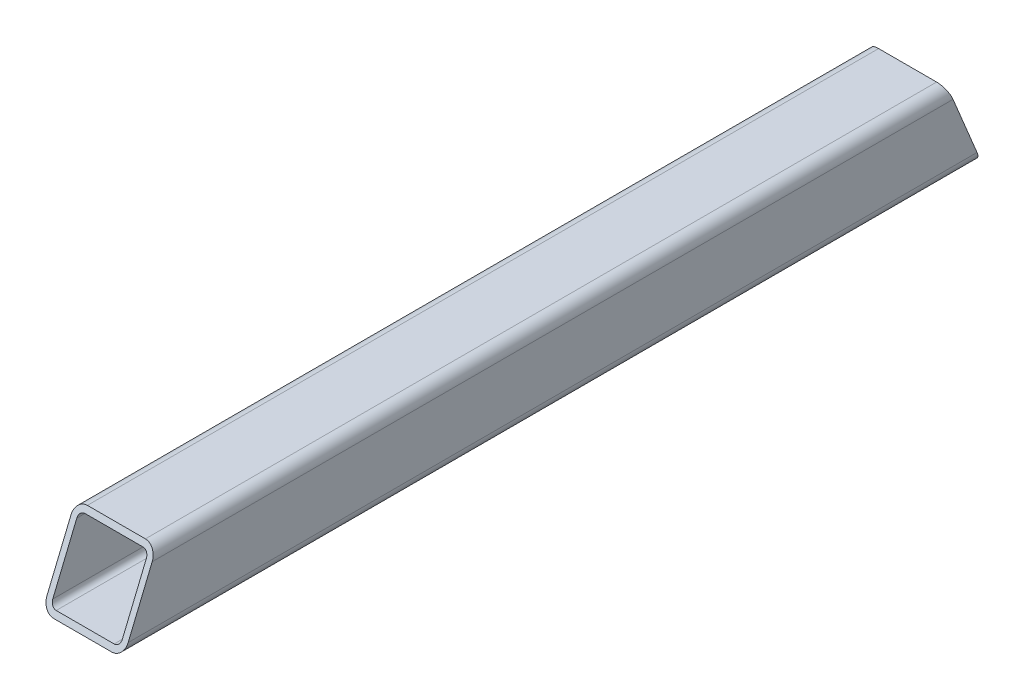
ISO-10303-21;
HEADER;
FILE_DESCRIPTION(('STEP AP214'),'2;1');
FILE_NAME('part.step','',(''),(''),'','','');
FILE_SCHEMA(('AUTOMOTIVE_DESIGN { 1 0 10303 214 1 1 1 1 }'));
ENDSEC;
DATA;
#1=APPLICATION_CONTEXT('core data for automotive mechanical design processes');
#2=APPLICATION_PROTOCOL_DEFINITION('international standard','automotive_design',2000,#1);
#3=PRODUCT_CONTEXT('',#1,'mechanical');
#4=PRODUCT('Part','Part','',(#3));
#5=PRODUCT_RELATED_PRODUCT_CATEGORY('part','',(#4));
#6=PRODUCT_DEFINITION_FORMATION('','',#4);
#7=PRODUCT_DEFINITION_CONTEXT('part definition',#1,'design');
#8=PRODUCT_DEFINITION('design','',#6,#7);
#9=PRODUCT_DEFINITION_SHAPE('','',#8);
#10=(LENGTH_UNIT() NAMED_UNIT(*) SI_UNIT(.MILLI.,.METRE.));
#11=(NAMED_UNIT(*) PLANE_ANGLE_UNIT() SI_UNIT($,.RADIAN.));
#12=(NAMED_UNIT(*) SI_UNIT($,.STERADIAN.) SOLID_ANGLE_UNIT());
#13=UNCERTAINTY_MEASURE_WITH_UNIT(LENGTH_MEASURE(1.E-05),#10,'distance_accuracy_value','');
#14=(GEOMETRIC_REPRESENTATION_CONTEXT(3) GLOBAL_UNCERTAINTY_ASSIGNED_CONTEXT((#13)) GLOBAL_UNIT_ASSIGNED_CONTEXT((#10,
#11,#12)) REPRESENTATION_CONTEXT('',''));
#15=CARTESIAN_POINT('',(0.,0.,0.));
#16=DIRECTION('',(0.,0.,1.));
#17=DIRECTION('',(1.,0.,0.));
#18=AXIS2_PLACEMENT_3D('',#15,#16,#17);
#19=CARTESIAN_POINT('',(-25.,-25.,370.));
#20=DIRECTION('',(0.,0.,-1.));
#21=DIRECTION('',(-1.,0.,0.));
#22=AXIS2_PLACEMENT_3D('',#19,#20,#21);
#23=CYLINDRICAL_SURFACE('',#22,9.99999999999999);
#24=DIRECTION('',(0.,0.,-1.));
#25=VECTOR('',#24,1.);
#26=CARTESIAN_POINT('',(-25.,-35.,370.));
#27=LINE('',#26,#25);
#28=CARTESIAN_POINT('',(-25.,-35.,370.));
#29=VERTEX_POINT('',#28);
#30=CARTESIAN_POINT('',(-25.,-35.,-370.));
#31=VERTEX_POINT('',#30);
#32=EDGE_CURVE('E39',#29,#31,#27,.T.);
#33=ORIENTED_EDGE('',*,*,#32,.F.);
#34=CARTESIAN_POINT('',(-25.,-25.,365.857864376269));
#35=DIRECTION('',(0.,-0.38268343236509,-0.923879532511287));
#36=DIRECTION('',(0.,0.923879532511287,-0.38268343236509));
#37=AXIS2_PLACEMENT_3D('',#34,#35,#36);
#38=ELLIPSE('',#37,10.8239220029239,9.99999999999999);
#39=CARTESIAN_POINT('',(-35.,-25.,365.857864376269));
#40=VERTEX_POINT('',#39);
#41=EDGE_CURVE('E162',#29,#40,#38,.T.);
#42=ORIENTED_EDGE('',*,*,#41,.T.);
#43=DIRECTION('',(0.,0.,-1.));
#44=VECTOR('',#43,1.);
#45=CARTESIAN_POINT('',(-35.,-25.,370.));
#46=LINE('',#45,#44);
#47=CARTESIAN_POINT('',(-35.,-25.,-365.857864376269));
#48=VERTEX_POINT('',#47);
#49=EDGE_CURVE('E167',#40,#48,#46,.T.);
#50=ORIENTED_EDGE('',*,*,#49,.T.);
#51=CARTESIAN_POINT('',(-25.,-25.,-365.857864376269));
#52=DIRECTION('',(0.,0.38268343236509,-0.923879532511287));
#53=DIRECTION('',(0.,-0.923879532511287,-0.38268343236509));
#54=AXIS2_PLACEMENT_3D('',#51,#52,#53);
#55=ELLIPSE('',#54,10.8239220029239,9.99999999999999);
#56=EDGE_CURVE('E188',#31,#48,#55,.T.);
#57=ORIENTED_EDGE('',*,*,#56,.F.);
#58=EDGE_LOOP('',(#33,#42,#50,#57));
#59=FACE_BOUND('',#58,.T.);
#60=ADVANCED_FACE('F32',(#59),#23,.T.);
#61=CARTESIAN_POINT('',(25.,-25.,370.));
#62=DIRECTION('',(0.,0.,-1.));
#63=DIRECTION('',(-1.,0.,0.));
#64=AXIS2_PLACEMENT_3D('',#61,#62,#63);
#65=CYLINDRICAL_SURFACE('',#64,10.);
#66=DIRECTION('',(0.,0.,-1.));
#67=VECTOR('',#66,1.);
#68=CARTESIAN_POINT('',(35.,-25.,370.));
#69=LINE('',#68,#67);
#70=CARTESIAN_POINT('',(35.,-25.,365.857864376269));
#71=VERTEX_POINT('',#70);
#72=CARTESIAN_POINT('',(35.,-25.,-365.857864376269));
#73=VERTEX_POINT('',#72);
#74=EDGE_CURVE('E156',#71,#73,#69,.T.);
#75=ORIENTED_EDGE('',*,*,#74,.F.);
#76=CARTESIAN_POINT('',(25.,-25.,365.857864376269));
#77=DIRECTION('',(0.,-0.38268343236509,-0.923879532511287));
#78=DIRECTION('',(0.,0.923879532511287,-0.38268343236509));
#79=AXIS2_PLACEMENT_3D('',#76,#77,#78);
#80=ELLIPSE('',#79,10.8239220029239,10.);
#81=CARTESIAN_POINT('',(24.9999999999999,-35.,370.));
#82=VERTEX_POINT('',#81);
#83=EDGE_CURVE('E159',#71,#82,#80,.T.);
#84=ORIENTED_EDGE('',*,*,#83,.T.);
#85=DIRECTION('',(0.,0.,-1.));
#86=VECTOR('',#85,1.);
#87=CARTESIAN_POINT('',(25.,-35.,370.));
#88=LINE('',#87,#86);
#89=CARTESIAN_POINT('',(25.,-35.,-370.));
#90=VERTEX_POINT('',#89);
#91=EDGE_CURVE('E144',#82,#90,#88,.T.);
#92=ORIENTED_EDGE('',*,*,#91,.T.);
#93=CARTESIAN_POINT('',(25.,-25.,-365.857864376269));
#94=DIRECTION('',(0.,0.38268343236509,-0.923879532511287));
#95=DIRECTION('',(0.,-0.923879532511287,-0.38268343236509));
#96=AXIS2_PLACEMENT_3D('',#93,#94,#95);
#97=ELLIPSE('',#96,10.8239220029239,10.);
#98=EDGE_CURVE('E190',#73,#90,#97,.T.);
#99=ORIENTED_EDGE('',*,*,#98,.F.);
#100=EDGE_LOOP('',(#75,#84,#92,#99));
#101=FACE_BOUND('',#100,.T.);
#102=ADVANCED_FACE('F160',(#101),#65,.T.);
#103=CARTESIAN_POINT('',(35.,25.,370.));
#104=DIRECTION('',(-1.,0.,0.));
#105=DIRECTION('',(0.,-1.,0.));
#106=AXIS2_PLACEMENT_3D('',#103,#104,#105);
#107=PLANE('',#106);
#108=DIRECTION('',(0.,0.,-1.));
#109=VECTOR('',#108,1.);
#110=CARTESIAN_POINT('',(35.,25.,370.));
#111=LINE('',#110,#109);
#112=CARTESIAN_POINT('',(35.,25.,345.147186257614));
#113=VERTEX_POINT('',#112);
#114=CARTESIAN_POINT('',(35.,25.,-345.147186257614));
#115=VERTEX_POINT('',#114);
#116=EDGE_CURVE('E181',#113,#115,#111,.T.);
#117=ORIENTED_EDGE('',*,*,#116,.F.);
#118=DIRECTION('',(0.,-0.923879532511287,0.38268343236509));
#119=VECTOR('',#118,1.);
#120=CARTESIAN_POINT('',(35.,16.2132034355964,348.786796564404));
#121=LINE('',#120,#119);
#122=EDGE_CURVE('E46',#113,#71,#121,.T.);
#123=ORIENTED_EDGE('',*,*,#122,.T.);
#124=ORIENTED_EDGE('',*,*,#74,.T.);
#125=DIRECTION('',(0.,-0.923879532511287,-0.38268343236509));
#126=VECTOR('',#125,1.);
#127=CARTESIAN_POINT('',(35.,277.842712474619,-240.416305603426));
#128=LINE('',#127,#126);
#129=EDGE_CURVE('E193',#115,#73,#128,.T.);
#130=ORIENTED_EDGE('',*,*,#129,.F.);
#131=EDGE_LOOP('',(#117,#123,#124,#130));
#132=FACE_BOUND('',#131,.T.);
#133=ADVANCED_FACE('F250',(#132),#107,.F.);
#134=CARTESIAN_POINT('',(25.,25.,370.));
#135=DIRECTION('',(0.,0.,-1.));
#136=DIRECTION('',(-1.,0.,0.));
#137=AXIS2_PLACEMENT_3D('',#134,#135,#136);
#138=CYLINDRICAL_SURFACE('',#137,10.);
#139=DIRECTION('',(0.,0.,-1.));
#140=VECTOR('',#139,1.);
#141=CARTESIAN_POINT('',(25.,35.,370.));
#142=LINE('',#141,#140);
#143=CARTESIAN_POINT('',(25.,35.,341.005050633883));
#144=VERTEX_POINT('',#143);
#145=CARTESIAN_POINT('',(25.,35.,-341.005050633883));
#146=VERTEX_POINT('',#145);
#147=EDGE_CURVE('E179',#144,#146,#142,.T.);
#148=ORIENTED_EDGE('',*,*,#147,.F.);
#149=CARTESIAN_POINT('',(25.,25.,345.147186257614));
#150=DIRECTION('',(0.,-0.38268343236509,-0.923879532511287));
#151=DIRECTION('',(0.,0.923879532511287,-0.38268343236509));
#152=AXIS2_PLACEMENT_3D('',#149,#150,#151);
#153=ELLIPSE('',#152,10.8239220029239,10.);
#154=EDGE_CURVE('E54',#144,#113,#153,.T.);
#155=ORIENTED_EDGE('',*,*,#154,.T.);
#156=ORIENTED_EDGE('',*,*,#116,.T.);
#157=CARTESIAN_POINT('',(25.,25.,-345.147186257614));
#158=DIRECTION('',(0.,0.38268343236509,-0.923879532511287));
#159=DIRECTION('',(0.,-0.923879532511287,-0.38268343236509));
#160=AXIS2_PLACEMENT_3D('',#157,#158,#159);
#161=ELLIPSE('',#160,10.8239220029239,10.);
#162=EDGE_CURVE('E197',#146,#115,#161,.T.);
#163=ORIENTED_EDGE('',*,*,#162,.F.);
#164=EDGE_LOOP('',(#148,#155,#156,#163));
#165=FACE_BOUND('',#164,.T.);
#166=ADVANCED_FACE('F249',(#165),#138,.T.);
#167=CARTESIAN_POINT('',(-25.,35.,370.));
#168=DIRECTION('',(0.,-1.,0.));
#169=DIRECTION('',(0.,0.,-1.));
#170=AXIS2_PLACEMENT_3D('',#167,#168,#169);
#171=PLANE('',#170);
#172=DIRECTION('',(0.,0.,-1.));
#173=VECTOR('',#172,1.);
#174=CARTESIAN_POINT('',(-25.,35.,370.));
#175=LINE('',#174,#173);
#176=CARTESIAN_POINT('',(-25.,35.,341.005050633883));
#177=VERTEX_POINT('',#176);
#178=CARTESIAN_POINT('',(-25.,35.,-341.005050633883));
#179=VERTEX_POINT('',#178);
#180=EDGE_CURVE('E177',#177,#179,#175,.T.);
#181=ORIENTED_EDGE('',*,*,#180,.F.);
#182=DIRECTION('',(1.,0.,0.));
#183=VECTOR('',#182,1.);
#184=CARTESIAN_POINT('',(-25.,35.,341.005050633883));
#185=LINE('',#184,#183);
#186=EDGE_CURVE('E427',#177,#144,#185,.T.);
#187=ORIENTED_EDGE('',*,*,#186,.T.);
#188=ORIENTED_EDGE('',*,*,#147,.T.);
#189=DIRECTION('',(1.,0.,0.));
#190=VECTOR('',#189,1.);
#191=CARTESIAN_POINT('',(-25.,35.,-341.005050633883));
#192=LINE('',#191,#190);
#193=EDGE_CURVE('E245',#179,#146,#192,.T.);
#194=ORIENTED_EDGE('',*,*,#193,.F.);
#195=EDGE_LOOP('',(#181,#187,#188,#194));
#196=FACE_BOUND('',#195,.T.);
#197=ADVANCED_FACE('F257',(#196),#171,.F.);
#198=CARTESIAN_POINT('',(-25.,25.,370.));
#199=DIRECTION('',(0.,0.,-1.));
#200=DIRECTION('',(-1.,0.,0.));
#201=AXIS2_PLACEMENT_3D('',#198,#199,#200);
#202=CYLINDRICAL_SURFACE('',#201,9.99999999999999);
#203=DIRECTION('',(0.,0.,-1.));
#204=VECTOR('',#203,1.);
#205=CARTESIAN_POINT('',(-35.,25.,370.));
#206=LINE('',#205,#204);
#207=CARTESIAN_POINT('',(-35.,25.,345.147186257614));
#208=VERTEX_POINT('',#207);
#209=CARTESIAN_POINT('',(-35.,25.,-345.147186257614));
#210=VERTEX_POINT('',#209);
#211=EDGE_CURVE('E169',#208,#210,#206,.T.);
#212=ORIENTED_EDGE('',*,*,#211,.F.);
#213=CARTESIAN_POINT('',(-25.,25.,345.147186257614));
#214=DIRECTION('',(0.,-0.38268343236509,-0.923879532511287));
#215=DIRECTION('',(0.,0.923879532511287,-0.38268343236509));
#216=AXIS2_PLACEMENT_3D('',#213,#214,#215);
#217=ELLIPSE('',#216,10.8239220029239,9.99999999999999);
#218=EDGE_CURVE('E425',#208,#177,#217,.T.);
#219=ORIENTED_EDGE('',*,*,#218,.T.);
#220=ORIENTED_EDGE('',*,*,#180,.T.);
#221=CARTESIAN_POINT('',(-25.,25.,-345.147186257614));
#222=DIRECTION('',(0.,0.38268343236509,-0.923879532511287));
#223=DIRECTION('',(0.,-0.923879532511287,-0.38268343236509));
#224=AXIS2_PLACEMENT_3D('',#221,#222,#223);
#225=ELLIPSE('',#224,10.8239220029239,9.99999999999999);
#226=EDGE_CURVE('E242',#210,#179,#225,.T.);
#227=ORIENTED_EDGE('',*,*,#226,.F.);
#228=EDGE_LOOP('',(#212,#219,#220,#227));
#229=FACE_BOUND('',#228,.T.);
#230=ADVANCED_FACE('F287',(#229),#202,.T.);
#231=CARTESIAN_POINT('',(-35.,25.,370.));
#232=DIRECTION('',(1.,0.,0.));
#233=DIRECTION('',(0.,0.,-1.));
#234=AXIS2_PLACEMENT_3D('',#231,#232,#233);
#235=PLANE('',#234);
#236=ORIENTED_EDGE('',*,*,#49,.F.);
#237=DIRECTION('',(0.,0.923879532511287,-0.38268343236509));
#238=VECTOR('',#237,1.);
#239=CARTESIAN_POINT('',(-35.,16.2132034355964,348.786796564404));
#240=LINE('',#239,#238);
#241=EDGE_CURVE('E418',#40,#208,#240,.T.);
#242=ORIENTED_EDGE('',*,*,#241,.T.);
#243=ORIENTED_EDGE('',*,*,#211,.T.);
#244=DIRECTION('',(0.,0.923879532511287,0.38268343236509));
#245=VECTOR('',#244,1.);
#246=CARTESIAN_POINT('',(-35.,277.842712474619,-240.416305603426));
#247=LINE('',#246,#245);
#248=EDGE_CURVE('E232',#48,#210,#247,.T.);
#249=ORIENTED_EDGE('',*,*,#248,.F.);
#250=EDGE_LOOP('',(#236,#242,#243,#249));
#251=FACE_BOUND('',#250,.T.);
#252=ADVANCED_FACE('F297',(#251),#235,.F.);
#253=CARTESIAN_POINT('',(-25.,25.,370.));
#254=DIRECTION('',(0.,0.,-1.));
#255=DIRECTION('',(-1.,0.,0.));
#256=AXIS2_PLACEMENT_3D('',#253,#254,#255);
#257=CYLINDRICAL_SURFACE('',#256,5.);
#258=CARTESIAN_POINT('',(-25.,25.,345.147186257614));
#259=DIRECTION('',(0.,-0.38268343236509,-0.923879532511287));
#260=DIRECTION('',(0.,0.923879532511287,-0.38268343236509));
#261=AXIS2_PLACEMENT_3D('',#258,#259,#260);
#262=ELLIPSE('',#261,5.41196100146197,5.);
#263=CARTESIAN_POINT('',(-30.,25.,345.147186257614));
#264=VERTEX_POINT('',#263);
#265=CARTESIAN_POINT('',(-25.,30.,343.076118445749));
#266=VERTEX_POINT('',#265);
#267=EDGE_CURVE('E224',#264,#266,#262,.T.);
#268=ORIENTED_EDGE('',*,*,#267,.F.);
#269=DIRECTION('',(0.,0.,-1.));
#270=VECTOR('',#269,1.);
#271=CARTESIAN_POINT('',(-30.,25.,370.));
#272=LINE('',#271,#270);
#273=CARTESIAN_POINT('',(-30.,25.,-345.147186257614));
#274=VERTEX_POINT('',#273);
#275=EDGE_CURVE('E171',#264,#274,#272,.T.);
#276=ORIENTED_EDGE('',*,*,#275,.T.);
#277=CARTESIAN_POINT('',(-25.,25.,-345.147186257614));
#278=DIRECTION('',(0.,0.38268343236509,-0.923879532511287));
#279=DIRECTION('',(0.,-0.923879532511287,-0.38268343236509));
#280=AXIS2_PLACEMENT_3D('',#277,#278,#279);
#281=ELLIPSE('',#280,5.41196100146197,5.);
#282=CARTESIAN_POINT('',(-25.,30.,-343.076118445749));
#283=VERTEX_POINT('',#282);
#284=EDGE_CURVE('E222',#274,#283,#281,.T.);
#285=ORIENTED_EDGE('',*,*,#284,.T.);
#286=DIRECTION('',(0.,0.,-1.));
#287=VECTOR('',#286,1.);
#288=CARTESIAN_POINT('',(-25.,30.,370.));
#289=LINE('',#288,#287);
#290=EDGE_CURVE('E195',#266,#283,#289,.T.);
#291=ORIENTED_EDGE('',*,*,#290,.F.);
#292=EDGE_LOOP('',(#268,#276,#285,#291));
#293=FACE_BOUND('',#292,.T.);
#294=ADVANCED_FACE('F220',(#293),#257,.F.);
#295=CARTESIAN_POINT('',(-30.,25.,370.));
#296=DIRECTION('',(1.,0.,0.));
#297=DIRECTION('',(0.,1.,0.));
#298=AXIS2_PLACEMENT_3D('',#295,#296,#297);
#299=PLANE('',#298);
#300=DIRECTION('',(0.,0.923879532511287,-0.38268343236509));
#301=VECTOR('',#300,1.);
#302=CARTESIAN_POINT('',(-30.,16.2132034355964,348.786796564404));
#303=LINE('',#302,#301);
#304=CARTESIAN_POINT('',(-30.,-25.,365.857864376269));
#305=VERTEX_POINT('',#304);
#306=EDGE_CURVE('E413',#305,#264,#303,.T.);
#307=ORIENTED_EDGE('',*,*,#306,.F.);
#308=DIRECTION('',(0.,0.,-1.));
#309=VECTOR('',#308,1.);
#310=CARTESIAN_POINT('',(-30.,-25.,370.));
#311=LINE('',#310,#309);
#312=CARTESIAN_POINT('',(-30.,-25.,-365.857864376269));
#313=VERTEX_POINT('',#312);
#314=EDGE_CURVE('E211',#305,#313,#311,.T.);
#315=ORIENTED_EDGE('',*,*,#314,.T.);
#316=DIRECTION('',(0.,0.923879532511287,0.38268343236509));
#317=VECTOR('',#316,1.);
#318=CARTESIAN_POINT('',(-30.,277.842712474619,-240.416305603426));
#319=LINE('',#318,#317);
#320=EDGE_CURVE('E229',#313,#274,#319,.T.);
#321=ORIENTED_EDGE('',*,*,#320,.T.);
#322=ORIENTED_EDGE('',*,*,#275,.F.);
#323=EDGE_LOOP('',(#307,#315,#321,#322));
#324=FACE_BOUND('',#323,.T.);
#325=ADVANCED_FACE('F234',(#324),#299,.T.);
#326=CARTESIAN_POINT('',(-25.,-25.,370.));
#327=DIRECTION('',(0.,0.,-1.));
#328=DIRECTION('',(-1.,0.,0.));
#329=AXIS2_PLACEMENT_3D('',#326,#327,#328);
#330=CYLINDRICAL_SURFACE('',#329,5.);
#331=CARTESIAN_POINT('',(-25.,-25.,365.857864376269));
#332=DIRECTION('',(0.,-0.38268343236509,-0.923879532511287));
#333=DIRECTION('',(0.,0.923879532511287,-0.38268343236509));
#334=AXIS2_PLACEMENT_3D('',#331,#332,#333);
#335=ELLIPSE('',#334,5.41196100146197,5.);
#336=CARTESIAN_POINT('',(-25.,-30.,367.928932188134));
#337=VERTEX_POINT('',#336);
#338=EDGE_CURVE('E416',#337,#305,#335,.T.);
#339=ORIENTED_EDGE('',*,*,#338,.F.);
#340=DIRECTION('',(0.,0.,-1.));
#341=VECTOR('',#340,1.);
#342=CARTESIAN_POINT('',(-25.,-30.,370.));
#343=LINE('',#342,#341);
#344=CARTESIAN_POINT('',(-25.,-30.,-367.928932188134));
#345=VERTEX_POINT('',#344);
#346=EDGE_CURVE('E210',#337,#345,#343,.T.);
#347=ORIENTED_EDGE('',*,*,#346,.T.);
#348=CARTESIAN_POINT('',(-25.,-25.,-365.857864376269));
#349=DIRECTION('',(0.,0.38268343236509,-0.923879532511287));
#350=DIRECTION('',(0.,-0.923879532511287,-0.38268343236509));
#351=AXIS2_PLACEMENT_3D('',#348,#349,#350);
#352=ELLIPSE('',#351,5.41196100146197,5.);
#353=EDGE_CURVE('E235',#345,#313,#352,.T.);
#354=ORIENTED_EDGE('',*,*,#353,.T.);
#355=ORIENTED_EDGE('',*,*,#314,.F.);
#356=EDGE_LOOP('',(#339,#347,#354,#355));
#357=FACE_BOUND('',#356,.T.);
#358=ADVANCED_FACE('F324',(#357),#330,.F.);
#359=CARTESIAN_POINT('',(-25.,-30.,370.));
#360=DIRECTION('',(0.,1.,0.));
#361=DIRECTION('',(-1.,0.,0.));
#362=AXIS2_PLACEMENT_3D('',#359,#360,#361);
#363=PLANE('',#362);
#364=DIRECTION('',(-1.,0.,0.));
#365=VECTOR('',#364,1.);
#366=CARTESIAN_POINT('',(-25.,-30.,367.928932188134));
#367=LINE('',#366,#365);
#368=CARTESIAN_POINT('',(25.,-30.,367.928932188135));
#369=VERTEX_POINT('',#368);
#370=EDGE_CURVE('E420',#369,#337,#367,.T.);
#371=ORIENTED_EDGE('',*,*,#370,.F.);
#372=DIRECTION('',(0.,0.,-1.));
#373=VECTOR('',#372,1.);
#374=CARTESIAN_POINT('',(25.,-30.,370.));
#375=LINE('',#374,#373);
#376=CARTESIAN_POINT('',(25.,-30.,-367.928932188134));
#377=VERTEX_POINT('',#376);
#378=EDGE_CURVE('E208',#369,#377,#375,.T.);
#379=ORIENTED_EDGE('',*,*,#378,.T.);
#380=DIRECTION('',(-1.,0.,0.));
#381=VECTOR('',#380,1.);
#382=CARTESIAN_POINT('',(-24.9999999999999,-30.,-367.928932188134));
#383=LINE('',#382,#381);
#384=EDGE_CURVE('E237',#377,#345,#383,.T.);
#385=ORIENTED_EDGE('',*,*,#384,.T.);
#386=ORIENTED_EDGE('',*,*,#346,.F.);
#387=EDGE_LOOP('',(#371,#379,#385,#386));
#388=FACE_BOUND('',#387,.T.);
#389=ADVANCED_FACE('F333',(#388),#363,.T.);
#390=CARTESIAN_POINT('',(25.,-25.,370.));
#391=DIRECTION('',(0.,0.,-1.));
#392=DIRECTION('',(-1.,0.,0.));
#393=AXIS2_PLACEMENT_3D('',#390,#391,#392);
#394=CYLINDRICAL_SURFACE('',#393,4.99999999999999);
#395=CARTESIAN_POINT('',(25.,-25.,365.857864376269));
#396=DIRECTION('',(0.,-0.38268343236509,-0.923879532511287));
#397=DIRECTION('',(0.,0.923879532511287,-0.38268343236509));
#398=AXIS2_PLACEMENT_3D('',#395,#396,#397);
#399=ELLIPSE('',#398,5.41196100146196,4.99999999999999);
#400=CARTESIAN_POINT('',(30.,-25.,365.857864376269));
#401=VERTEX_POINT('',#400);
#402=EDGE_CURVE('E448',#401,#369,#399,.T.);
#403=ORIENTED_EDGE('',*,*,#402,.F.);
#404=DIRECTION('',(0.,0.,-1.));
#405=VECTOR('',#404,1.);
#406=CARTESIAN_POINT('',(30.,-25.,370.));
#407=LINE('',#406,#405);
#408=CARTESIAN_POINT('',(30.,-25.,-365.857864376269));
#409=VERTEX_POINT('',#408);
#410=EDGE_CURVE('E206',#401,#409,#407,.T.);
#411=ORIENTED_EDGE('',*,*,#410,.T.);
#412=CARTESIAN_POINT('',(25.,-25.,-365.857864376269));
#413=DIRECTION('',(0.,0.38268343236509,-0.923879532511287));
#414=DIRECTION('',(0.,-0.923879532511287,-0.38268343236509));
#415=AXIS2_PLACEMENT_3D('',#412,#413,#414);
#416=ELLIPSE('',#415,5.41196100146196,4.99999999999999);
#417=EDGE_CURVE('E438',#409,#377,#416,.T.);
#418=ORIENTED_EDGE('',*,*,#417,.T.);
#419=ORIENTED_EDGE('',*,*,#378,.F.);
#420=EDGE_LOOP('',(#403,#411,#418,#419));
#421=FACE_BOUND('',#420,.T.);
#422=ADVANCED_FACE('F343',(#421),#394,.F.);
#423=CARTESIAN_POINT('',(30.,25.,370.));
#424=DIRECTION('',(-1.,0.,0.));
#425=DIRECTION('',(0.,-1.,0.));
#426=AXIS2_PLACEMENT_3D('',#423,#424,#425);
#427=PLANE('',#426);
#428=DIRECTION('',(0.,-0.923879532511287,0.38268343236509));
#429=VECTOR('',#428,1.);
#430=CARTESIAN_POINT('',(30.,16.2132034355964,348.786796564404));
#431=LINE('',#430,#429);
#432=CARTESIAN_POINT('',(30.,25.,345.147186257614));
#433=VERTEX_POINT('',#432);
#434=EDGE_CURVE('E450',#433,#401,#431,.T.);
#435=ORIENTED_EDGE('',*,*,#434,.F.);
#436=DIRECTION('',(0.,0.,-1.));
#437=VECTOR('',#436,1.);
#438=CARTESIAN_POINT('',(30.,25.,370.));
#439=LINE('',#438,#437);
#440=CARTESIAN_POINT('',(30.,25.,-345.147186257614));
#441=VERTEX_POINT('',#440);
#442=EDGE_CURVE('E204',#433,#441,#439,.T.);
#443=ORIENTED_EDGE('',*,*,#442,.T.);
#444=DIRECTION('',(0.,-0.923879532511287,-0.38268343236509));
#445=VECTOR('',#444,1.);
#446=CARTESIAN_POINT('',(30.,277.842712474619,-240.416305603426));
#447=LINE('',#446,#445);
#448=EDGE_CURVE('E435',#441,#409,#447,.T.);
#449=ORIENTED_EDGE('',*,*,#448,.T.);
#450=ORIENTED_EDGE('',*,*,#410,.F.);
#451=EDGE_LOOP('',(#435,#443,#449,#450));
#452=FACE_BOUND('',#451,.T.);
#453=ADVANCED_FACE('F353',(#452),#427,.T.);
#454=CARTESIAN_POINT('',(25.,25.,370.));
#455=DIRECTION('',(0.,0.,-1.));
#456=DIRECTION('',(-1.,0.,0.));
#457=AXIS2_PLACEMENT_3D('',#454,#455,#456);
#458=CYLINDRICAL_SURFACE('',#457,5.);
#459=CARTESIAN_POINT('',(25.,25.,345.147186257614));
#460=DIRECTION('',(0.,-0.38268343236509,-0.923879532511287));
#461=DIRECTION('',(0.,0.923879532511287,-0.38268343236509));
#462=AXIS2_PLACEMENT_3D('',#459,#460,#461);
#463=ELLIPSE('',#462,5.41196100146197,5.);
#464=CARTESIAN_POINT('',(25.,30.,343.076118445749));
#465=VERTEX_POINT('',#464);
#466=EDGE_CURVE('E454',#465,#433,#463,.T.);
#467=ORIENTED_EDGE('',*,*,#466,.F.);
#468=DIRECTION('',(0.,0.,-1.));
#469=VECTOR('',#468,1.);
#470=CARTESIAN_POINT('',(25.,30.,370.));
#471=LINE('',#470,#469);
#472=CARTESIAN_POINT('',(25.,30.,-343.076118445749));
#473=VERTEX_POINT('',#472);
#474=EDGE_CURVE('E202',#465,#473,#471,.T.);
#475=ORIENTED_EDGE('',*,*,#474,.T.);
#476=CARTESIAN_POINT('',(25.,25.,-345.147186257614));
#477=DIRECTION('',(0.,0.38268343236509,-0.923879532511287));
#478=DIRECTION('',(0.,-0.923879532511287,-0.38268343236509));
#479=AXIS2_PLACEMENT_3D('',#476,#477,#478);
#480=ELLIPSE('',#479,5.41196100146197,5.);
#481=EDGE_CURVE('E432',#473,#441,#480,.T.);
#482=ORIENTED_EDGE('',*,*,#481,.T.);
#483=ORIENTED_EDGE('',*,*,#442,.F.);
#484=EDGE_LOOP('',(#467,#475,#482,#483));
#485=FACE_BOUND('',#484,.T.);
#486=ADVANCED_FACE('F363',(#485),#458,.F.);
#487=CARTESIAN_POINT('',(-25.,30.,370.));
#488=DIRECTION('',(0.,-1.,0.));
#489=DIRECTION('',(0.,0.,-1.));
#490=AXIS2_PLACEMENT_3D('',#487,#488,#489);
#491=PLANE('',#490);
#492=DIRECTION('',(1.,0.,0.));
#493=VECTOR('',#492,1.);
#494=CARTESIAN_POINT('',(-25.,30.,343.076118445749));
#495=LINE('',#494,#493);
#496=EDGE_CURVE('E457',#266,#465,#495,.T.);
#497=ORIENTED_EDGE('',*,*,#496,.F.);
#498=ORIENTED_EDGE('',*,*,#290,.T.);
#499=DIRECTION('',(1.,0.,0.));
#500=VECTOR('',#499,1.);
#501=CARTESIAN_POINT('',(-25.,30.,-343.076118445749));
#502=LINE('',#501,#500);
#503=EDGE_CURVE('E11',#283,#473,#502,.T.);
#504=ORIENTED_EDGE('',*,*,#503,.T.);
#505=ORIENTED_EDGE('',*,*,#474,.F.);
#506=EDGE_LOOP('',(#497,#498,#504,#505));
#507=FACE_BOUND('',#506,.T.);
#508=ADVANCED_FACE('F373',(#507),#491,.T.);
#509=CARTESIAN_POINT('',(-25.,-35.,370.));
#510=DIRECTION('',(0.,1.,0.));
#511=DIRECTION('',(-1.,0.,0.));
#512=AXIS2_PLACEMENT_3D('',#509,#510,#511);
#513=PLANE('',#512);
#514=DIRECTION('',(1.,0.,0.));
#515=VECTOR('',#514,1.);
#516=CARTESIAN_POINT('',(-25.,-35.,-370.));
#517=LINE('',#516,#515);
#518=EDGE_CURVE('E152',#31,#90,#517,.T.);
#519=ORIENTED_EDGE('',*,*,#518,.T.);
#520=ORIENTED_EDGE('',*,*,#91,.F.);
#521=DIRECTION('',(1.,0.,0.));
#522=VECTOR('',#521,1.);
#523=CARTESIAN_POINT('',(-25.,-35.,370.));
#524=LINE('',#523,#522);
#525=EDGE_CURVE('E149',#29,#82,#524,.T.);
#526=ORIENTED_EDGE('',*,*,#525,.F.);
#527=ORIENTED_EDGE('',*,*,#32,.T.);
#528=EDGE_LOOP('',(#519,#520,#526,#527));
#529=FACE_BOUND('',#528,.T.);
#530=ADVANCED_FACE('F146',(#529),#513,.F.);
#531=CARTESIAN_POINT('',(1043.2403227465,-35.0000000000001,-370.));
#532=DIRECTION('',(0.,0.38268343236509,-0.923879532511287));
#533=DIRECTION('',(0.,0.923879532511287,0.38268343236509));
#534=AXIS2_PLACEMENT_3D('',#531,#532,#533);
#535=PLANE('',#534);
#536=ORIENTED_EDGE('',*,*,#284,.F.);
#537=ORIENTED_EDGE('',*,*,#320,.F.);
#538=ORIENTED_EDGE('',*,*,#353,.F.);
#539=ORIENTED_EDGE('',*,*,#384,.F.);
#540=ORIENTED_EDGE('',*,*,#417,.F.);
#541=ORIENTED_EDGE('',*,*,#448,.F.);
#542=ORIENTED_EDGE('',*,*,#481,.F.);
#543=ORIENTED_EDGE('',*,*,#503,.F.);
#544=EDGE_LOOP('',(#536,#537,#538,#539,#540,#541,#542,#543));
#545=FACE_BOUND('',#544,.T.);
#546=ORIENTED_EDGE('',*,*,#518,.F.);
#547=ORIENTED_EDGE('',*,*,#56,.T.);
#548=ORIENTED_EDGE('',*,*,#248,.T.);
#549=ORIENTED_EDGE('',*,*,#226,.T.);
#550=ORIENTED_EDGE('',*,*,#193,.T.);
#551=ORIENTED_EDGE('',*,*,#162,.T.);
#552=ORIENTED_EDGE('',*,*,#129,.T.);
#553=ORIENTED_EDGE('',*,*,#98,.T.);
#554=EDGE_LOOP('',(#546,#547,#548,#549,#550,#551,#552,#553));
#555=FACE_BOUND('',#554,.T.);
#556=ADVANCED_FACE('F186',(#545,#555),#535,.T.);
#557=CARTESIAN_POINT('',(1043.2403227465,-35.0000000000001,370.));
#558=DIRECTION('',(0.,-0.38268343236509,-0.923879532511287));
#559=DIRECTION('',(0.,0.923879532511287,-0.38268343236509));
#560=AXIS2_PLACEMENT_3D('',#557,#558,#559);
#561=PLANE('',#560);
#562=ORIENTED_EDGE('',*,*,#306,.T.);
#563=ORIENTED_EDGE('',*,*,#267,.T.);
#564=ORIENTED_EDGE('',*,*,#496,.T.);
#565=ORIENTED_EDGE('',*,*,#466,.T.);
#566=ORIENTED_EDGE('',*,*,#434,.T.);
#567=ORIENTED_EDGE('',*,*,#402,.T.);
#568=ORIENTED_EDGE('',*,*,#370,.T.);
#569=ORIENTED_EDGE('',*,*,#338,.T.);
#570=EDGE_LOOP('',(#562,#563,#564,#565,#566,#567,#568,#569));
#571=FACE_BOUND('',#570,.T.);
#572=ORIENTED_EDGE('',*,*,#41,.F.);
#573=ORIENTED_EDGE('',*,*,#525,.T.);
#574=ORIENTED_EDGE('',*,*,#83,.F.);
#575=ORIENTED_EDGE('',*,*,#122,.F.);
#576=ORIENTED_EDGE('',*,*,#154,.F.);
#577=ORIENTED_EDGE('',*,*,#186,.F.);
#578=ORIENTED_EDGE('',*,*,#218,.F.);
#579=ORIENTED_EDGE('',*,*,#241,.F.);
#580=EDGE_LOOP('',(#572,#573,#574,#575,#576,#577,#578,#579));
#581=FACE_BOUND('',#580,.T.);
#582=ADVANCED_FACE('F165',(#571,#581),#561,.F.);
#583=CLOSED_SHELL('',(#60,#102,#133,#166,#197,#230,#252,#294,#325,#358,#389,#422,#453,#486,#508,
#530,#556,#582));
#584=MANIFOLD_SOLID_BREP('B2',#583);
#585=ADVANCED_BREP_SHAPE_REPRESENTATION('',(#18,#584),#14);
#586=SHAPE_DEFINITION_REPRESENTATION(#9,#585);
ENDSEC;
END-ISO-10303-21;
